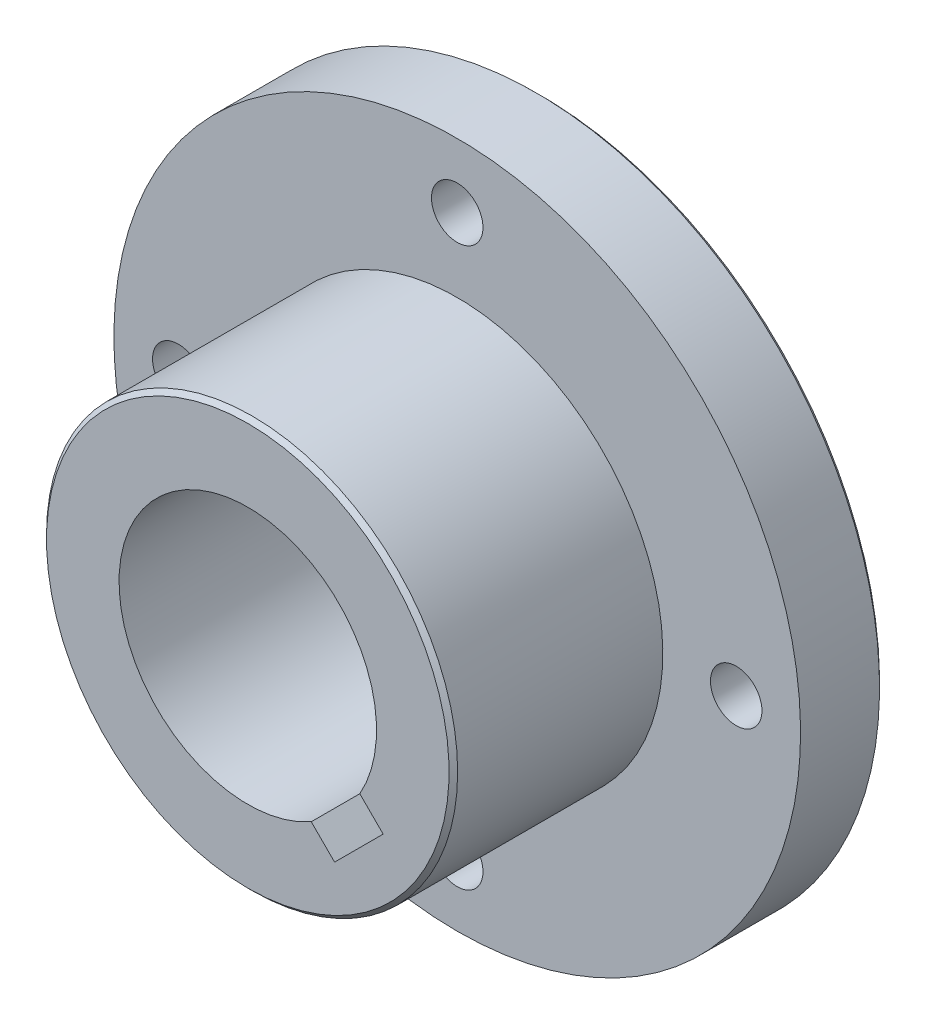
ISO-10303-21;
HEADER;
FILE_DESCRIPTION(('STEP AP214'),'2;1');
FILE_NAME('part.step','',(''),(''),'','','');
FILE_SCHEMA(('AUTOMOTIVE_DESIGN { 1 0 10303 214 1 1 1 1 }'));
ENDSEC;
DATA;
#1=APPLICATION_CONTEXT('core data for automotive mechanical design processes');
#2=APPLICATION_PROTOCOL_DEFINITION('international standard','automotive_design',2000,#1);
#3=PRODUCT_CONTEXT('',#1,'mechanical');
#4=PRODUCT('Part','Part','',(#3));
#5=PRODUCT_RELATED_PRODUCT_CATEGORY('part','',(#4));
#6=PRODUCT_DEFINITION_FORMATION('','',#4);
#7=PRODUCT_DEFINITION_CONTEXT('part definition',#1,'design');
#8=PRODUCT_DEFINITION('design','',#6,#7);
#9=PRODUCT_DEFINITION_SHAPE('','',#8);
#10=(LENGTH_UNIT() NAMED_UNIT(*) SI_UNIT(.MILLI.,.METRE.));
#11=(NAMED_UNIT(*) PLANE_ANGLE_UNIT() SI_UNIT($,.RADIAN.));
#12=(NAMED_UNIT(*) SI_UNIT($,.STERADIAN.) SOLID_ANGLE_UNIT());
#13=UNCERTAINTY_MEASURE_WITH_UNIT(LENGTH_MEASURE(1.E-05),#10,'distance_accuracy_value','');
#14=(GEOMETRIC_REPRESENTATION_CONTEXT(3) GLOBAL_UNCERTAINTY_ASSIGNED_CONTEXT((#13)) GLOBAL_UNIT_ASSIGNED_CONTEXT((#10,
#11,#12)) REPRESENTATION_CONTEXT('',''));
#15=CARTESIAN_POINT('',(0.,0.,0.));
#16=DIRECTION('',(0.,0.,1.));
#17=DIRECTION('',(1.,0.,0.));
#18=AXIS2_PLACEMENT_3D('',#15,#16,#17);
#19=CARTESIAN_POINT('',(-167.832243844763,255.661668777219,11.9555293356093));
#20=DIRECTION('',(0.,0.,1.));
#21=DIRECTION('',(0.,-1.,0.));
#22=AXIS2_PLACEMENT_3D('',#19,#20,#21);
#23=CYLINDRICAL_SURFACE('',#22,40.);
#24=CARTESIAN_POINT('',(-167.832243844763,255.661668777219,16.5555293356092));
#25=DIRECTION('',(0.,0.,1.));
#26=DIRECTION('',(0.,-1.,0.));
#27=AXIS2_PLACEMENT_3D('',#24,#25,#26);
#28=CIRCLE('',#27,40.);
#29=CARTESIAN_POINT('',(-167.832243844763,215.661668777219,16.5555293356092));
#30=VERTEX_POINT('',#29);
#31=EDGE_CURVE('E131',#30,#30,#28,.T.);
#32=ORIENTED_EDGE('',*,*,#31,.F.);
#33=EDGE_LOOP('',(#32));
#34=FACE_BOUND('',#33,.T.);
#35=CARTESIAN_POINT('',(-167.832243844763,255.661668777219,7.35552933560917));
#36=DIRECTION('',(0.,0.,1.));
#37=DIRECTION('',(0.707106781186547,0.707106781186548,0.));
#38=AXIS2_PLACEMENT_3D('',#35,#36,#37);
#39=CIRCLE('',#38,39.9999999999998);
#40=CARTESIAN_POINT('',(-139.547972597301,283.945940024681,7.35552933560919));
#41=VERTEX_POINT('',#40);
#42=EDGE_CURVE('E103',#41,#41,#39,.F.);
#43=ORIENTED_EDGE('',*,*,#42,.F.);
#44=EDGE_LOOP('',(#43));
#45=FACE_BOUND('',#44,.T.);
#46=ADVANCED_FACE('F16',(#34,#45),#23,.T.);
#47=CARTESIAN_POINT('',(-135.332243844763,255.661668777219,6.85552933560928));
#48=DIRECTION('',(0.,0.,-1.));
#49=DIRECTION('',(0.,1.,0.));
#50=AXIS2_PLACEMENT_3D('',#47,#48,#49);
#51=CYLINDRICAL_SURFACE('',#50,3.);
#52=CARTESIAN_POINT('',(-135.332243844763,255.661668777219,16.5555293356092));
#53=DIRECTION('',(0.,0.,-1.));
#54=DIRECTION('',(0.,1.,0.));
#55=AXIS2_PLACEMENT_3D('',#52,#53,#54);
#56=CIRCLE('',#55,3.);
#57=CARTESIAN_POINT('',(-135.332243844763,258.661668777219,16.5555293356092));
#58=VERTEX_POINT('',#57);
#59=EDGE_CURVE('E20',#58,#58,#56,.T.);
#60=ORIENTED_EDGE('',*,*,#59,.F.);
#61=EDGE_LOOP('',(#60));
#62=FACE_BOUND('',#61,.T.);
#63=CARTESIAN_POINT('',(-135.332243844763,255.661668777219,6.85552933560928));
#64=DIRECTION('',(0.,0.,-1.));
#65=DIRECTION('',(0.,1.,0.));
#66=AXIS2_PLACEMENT_3D('',#63,#64,#65);
#67=CIRCLE('',#66,3.);
#68=CARTESIAN_POINT('',(-135.332243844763,258.661668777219,6.85552933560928));
#69=VERTEX_POINT('',#68);
#70=EDGE_CURVE('E128',#69,#69,#67,.F.);
#71=ORIENTED_EDGE('',*,*,#70,.F.);
#72=EDGE_LOOP('',(#71));
#73=FACE_BOUND('',#72,.T.);
#74=ADVANCED_FACE('F148',(#62,#73),#51,.F.);
#75=CARTESIAN_POINT('',(-167.832243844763,223.161668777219,6.85552933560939));
#76=DIRECTION('',(0.,0.,-1.));
#77=DIRECTION('',(0.,1.,0.));
#78=AXIS2_PLACEMENT_3D('',#75,#76,#77);
#79=CYLINDRICAL_SURFACE('',#78,3.);
#80=CARTESIAN_POINT('',(-167.832243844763,223.161668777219,16.5555293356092));
#81=DIRECTION('',(0.,0.,-1.));
#82=DIRECTION('',(0.,1.,0.));
#83=AXIS2_PLACEMENT_3D('',#80,#81,#82);
#84=CIRCLE('',#83,3.);
#85=CARTESIAN_POINT('',(-167.832243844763,226.161668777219,16.5555293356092));
#86=VERTEX_POINT('',#85);
#87=EDGE_CURVE('E139',#86,#86,#84,.T.);
#88=ORIENTED_EDGE('',*,*,#87,.F.);
#89=EDGE_LOOP('',(#88));
#90=FACE_BOUND('',#89,.T.);
#91=CARTESIAN_POINT('',(-167.832243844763,223.161668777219,6.85552933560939));
#92=DIRECTION('',(0.,0.,-1.));
#93=DIRECTION('',(0.,1.,0.));
#94=AXIS2_PLACEMENT_3D('',#91,#92,#93);
#95=CIRCLE('',#94,3.);
#96=CARTESIAN_POINT('',(-167.832243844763,226.161668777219,6.85552933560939));
#97=VERTEX_POINT('',#96);
#98=EDGE_CURVE('E125',#97,#97,#95,.F.);
#99=ORIENTED_EDGE('',*,*,#98,.F.);
#100=EDGE_LOOP('',(#99));
#101=FACE_BOUND('',#100,.T.);
#102=ADVANCED_FACE('F151',(#90,#101),#79,.F.);
#103=CARTESIAN_POINT('',(-200.332243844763,255.661668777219,6.85552933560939));
#104=DIRECTION('',(0.,0.,-1.));
#105=DIRECTION('',(0.,1.,0.));
#106=AXIS2_PLACEMENT_3D('',#103,#104,#105);
#107=CYLINDRICAL_SURFACE('',#106,3.);
#108=CARTESIAN_POINT('',(-200.332243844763,255.661668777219,16.5555293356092));
#109=DIRECTION('',(0.,0.,-1.));
#110=DIRECTION('',(0.,1.,0.));
#111=AXIS2_PLACEMENT_3D('',#108,#109,#110);
#112=CIRCLE('',#111,3.);
#113=CARTESIAN_POINT('',(-200.332243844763,258.661668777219,16.5555293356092));
#114=VERTEX_POINT('',#113);
#115=EDGE_CURVE('E137',#114,#114,#112,.T.);
#116=ORIENTED_EDGE('',*,*,#115,.F.);
#117=EDGE_LOOP('',(#116));
#118=FACE_BOUND('',#117,.T.);
#119=CARTESIAN_POINT('',(-200.332243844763,255.661668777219,6.85552933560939));
#120=DIRECTION('',(0.,0.,-1.));
#121=DIRECTION('',(0.,1.,0.));
#122=AXIS2_PLACEMENT_3D('',#119,#120,#121);
#123=CIRCLE('',#122,3.);
#124=CARTESIAN_POINT('',(-200.332243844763,258.661668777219,6.85552933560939));
#125=VERTEX_POINT('',#124);
#126=EDGE_CURVE('E122',#125,#125,#123,.F.);
#127=ORIENTED_EDGE('',*,*,#126,.F.);
#128=EDGE_LOOP('',(#127));
#129=FACE_BOUND('',#128,.T.);
#130=ADVANCED_FACE('F219',(#118,#129),#107,.F.);
#131=CARTESIAN_POINT('',(-167.832243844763,288.161668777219,6.85552933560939));
#132=DIRECTION('',(0.,0.,-1.));
#133=DIRECTION('',(0.,1.,0.));
#134=AXIS2_PLACEMENT_3D('',#131,#132,#133);
#135=CYLINDRICAL_SURFACE('',#134,3.);
#136=CARTESIAN_POINT('',(-167.832243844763,288.161668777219,16.5555293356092));
#137=DIRECTION('',(0.,0.,-1.));
#138=DIRECTION('',(0.,1.,0.));
#139=AXIS2_PLACEMENT_3D('',#136,#137,#138);
#140=CIRCLE('',#139,3.);
#141=CARTESIAN_POINT('',(-167.832243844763,291.161668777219,16.5555293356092));
#142=VERTEX_POINT('',#141);
#143=EDGE_CURVE('E134',#142,#142,#140,.T.);
#144=ORIENTED_EDGE('',*,*,#143,.F.);
#145=EDGE_LOOP('',(#144));
#146=FACE_BOUND('',#145,.T.);
#147=CARTESIAN_POINT('',(-167.832243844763,288.161668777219,6.85552933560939));
#148=DIRECTION('',(0.,0.,-1.));
#149=DIRECTION('',(0.,1.,0.));
#150=AXIS2_PLACEMENT_3D('',#147,#148,#149);
#151=CIRCLE('',#150,3.);
#152=CARTESIAN_POINT('',(-167.832243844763,291.161668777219,6.85552933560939));
#153=VERTEX_POINT('',#152);
#154=EDGE_CURVE('E119',#153,#153,#151,.F.);
#155=ORIENTED_EDGE('',*,*,#154,.F.);
#156=EDGE_LOOP('',(#155));
#157=FACE_BOUND('',#156,.T.);
#158=ADVANCED_FACE('F225',(#146,#157),#135,.F.);
#159=CARTESIAN_POINT('',(-167.832243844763,255.661668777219,7.35552933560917));
#160=DIRECTION('',(0.,0.,1.));
#161=DIRECTION('',(0.,-1.,0.));
#162=AXIS2_PLACEMENT_3D('',#159,#160,#161);
#163=CONICAL_SURFACE('',#162,39.9999999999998,0.785398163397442);
#164=ORIENTED_EDGE('',*,*,#42,.T.);
#165=EDGE_LOOP('',(#164));
#166=FACE_BOUND('',#165,.T.);
#167=CARTESIAN_POINT('',(-167.832243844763,255.661668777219,6.8555293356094));
#168=DIRECTION('',(0.,0.,1.));
#169=DIRECTION('',(0.,-1.,0.));
#170=AXIS2_PLACEMENT_3D('',#167,#168,#169);
#171=CIRCLE('',#170,39.5);
#172=CARTESIAN_POINT('',(-167.832243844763,216.161668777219,6.85552933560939));
#173=VERTEX_POINT('',#172);
#174=EDGE_CURVE('E116',#173,#173,#171,.F.);
#175=ORIENTED_EDGE('',*,*,#174,.F.);
#176=EDGE_LOOP('',(#175));
#177=FACE_BOUND('',#176,.T.);
#178=ADVANCED_FACE('F168',(#166,#177),#163,.T.);
#179=CARTESIAN_POINT('',(-145.222504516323,278.271408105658,16.5555293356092));
#180=DIRECTION('',(0.,0.,1.));
#181=DIRECTION('',(0.,-1.,0.));
#182=AXIS2_PLACEMENT_3D('',#179,#180,#181);
#183=PLANE('',#182);
#184=CARTESIAN_POINT('',(-167.832243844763,255.661668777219,16.5555293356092));
#185=DIRECTION('',(0.,0.,1.));
#186=DIRECTION('',(0.,-1.,0.));
#187=AXIS2_PLACEMENT_3D('',#184,#185,#186);
#188=CIRCLE('',#187,23.95);
#189=CARTESIAN_POINT('',(-167.832243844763,231.711668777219,16.5555293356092));
#190=VERTEX_POINT('',#189);
#191=EDGE_CURVE('E113',#190,#190,#188,.T.);
#192=ORIENTED_EDGE('',*,*,#191,.F.);
#193=EDGE_LOOP('',(#192));
#194=FACE_BOUND('',#193,.T.);
#195=ORIENTED_EDGE('',*,*,#31,.T.);
#196=EDGE_LOOP('',(#195));
#197=FACE_BOUND('',#196,.T.);
#198=ORIENTED_EDGE('',*,*,#143,.T.);
#199=EDGE_LOOP('',(#198));
#200=FACE_BOUND('',#199,.T.);
#201=ORIENTED_EDGE('',*,*,#115,.T.);
#202=EDGE_LOOP('',(#201));
#203=FACE_BOUND('',#202,.T.);
#204=ORIENTED_EDGE('',*,*,#87,.T.);
#205=EDGE_LOOP('',(#204));
#206=FACE_BOUND('',#205,.T.);
#207=ORIENTED_EDGE('',*,*,#59,.T.);
#208=EDGE_LOOP('',(#207));
#209=FACE_BOUND('',#208,.T.);
#210=ADVANCED_FACE('F146',(#194,#197,#200,#203,#206,#209),#183,.T.);
#211=CARTESIAN_POINT('',(-145.735156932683,277.758755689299,6.85552933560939));
#212=DIRECTION('',(0.,0.,-1.));
#213=DIRECTION('',(0.,1.,0.));
#214=AXIS2_PLACEMENT_3D('',#211,#212,#213);
#215=PLANE('',#214);
#216=ORIENTED_EDGE('',*,*,#174,.T.);
#217=EDGE_LOOP('',(#216));
#218=FACE_BOUND('',#217,.T.);
#219=CARTESIAN_POINT('',(-167.832243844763,255.661668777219,6.85552933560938));
#220=DIRECTION('',(0.,0.,1.));
#221=DIRECTION('',(0.,-1.,0.));
#222=AXIS2_PLACEMENT_3D('',#219,#220,#221);
#223=CIRCLE('',#222,23.);
#224=CARTESIAN_POINT('',(-167.832243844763,232.661668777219,6.85552933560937));
#225=VERTEX_POINT('',#224);
#226=EDGE_CURVE('E102',#225,#225,#223,.F.);
#227=ORIENTED_EDGE('',*,*,#226,.F.);
#228=EDGE_LOOP('',(#227));
#229=FACE_BOUND('',#228,.T.);
#230=ORIENTED_EDGE('',*,*,#154,.T.);
#231=EDGE_LOOP('',(#230));
#232=FACE_BOUND('',#231,.T.);
#233=ORIENTED_EDGE('',*,*,#126,.T.);
#234=EDGE_LOOP('',(#233));
#235=FACE_BOUND('',#234,.T.);
#236=ORIENTED_EDGE('',*,*,#98,.T.);
#237=EDGE_LOOP('',(#236));
#238=FACE_BOUND('',#237,.T.);
#239=ORIENTED_EDGE('',*,*,#70,.T.);
#240=EDGE_LOOP('',(#239));
#241=FACE_BOUND('',#240,.T.);
#242=ADVANCED_FACE('F155',(#218,#229,#232,#235,#238,#241),#215,.T.);
#243=CARTESIAN_POINT('',(-167.832243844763,255.661668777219,28.5055293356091));
#244=DIRECTION('',(0.,0.,1.));
#245=DIRECTION('',(0.,-1.,0.));
#246=AXIS2_PLACEMENT_3D('',#243,#244,#245);
#247=CYLINDRICAL_SURFACE('',#246,23.95);
#248=CARTESIAN_POINT('',(-167.832243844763,255.661668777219,40.4555293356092));
#249=DIRECTION('',(0.,0.,-1.));
#250=DIRECTION('',(0.707106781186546,0.707106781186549,0.));
#251=AXIS2_PLACEMENT_3D('',#248,#249,#250);
#252=CIRCLE('',#251,23.95);
#253=CARTESIAN_POINT('',(-150.897036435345,272.596876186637,40.4555293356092));
#254=VERTEX_POINT('',#253);
#255=EDGE_CURVE('E99',#254,#254,#252,.F.);
#256=ORIENTED_EDGE('',*,*,#255,.F.);
#257=EDGE_LOOP('',(#256));
#258=FACE_BOUND('',#257,.T.);
#259=ORIENTED_EDGE('',*,*,#191,.T.);
#260=EDGE_LOOP('',(#259));
#261=FACE_BOUND('',#260,.T.);
#262=ADVANCED_FACE('F157',(#258,#261),#247,.T.);
#263=CARTESIAN_POINT('',(-167.832243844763,255.661668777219,4.60552933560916));
#264=DIRECTION('',(0.,0.,1.));
#265=DIRECTION('',(0.,-1.,0.));
#266=AXIS2_PLACEMENT_3D('',#263,#264,#265);
#267=CYLINDRICAL_SURFACE('',#266,23.);
#268=ORIENTED_EDGE('',*,*,#226,.T.);
#269=EDGE_LOOP('',(#268));
#270=FACE_BOUND('',#269,.T.);
#271=CARTESIAN_POINT('',(-167.832243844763,255.661668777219,2.35552933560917));
#272=DIRECTION('',(0.,0.,1.));
#273=DIRECTION('',(0.707106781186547,0.707106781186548,0.));
#274=AXIS2_PLACEMENT_3D('',#271,#272,#273);
#275=CIRCLE('',#274,23.);
#276=CARTESIAN_POINT('',(-151.568787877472,271.925124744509,2.35552933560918));
#277=VERTEX_POINT('',#276);
#278=EDGE_CURVE('E91',#277,#277,#275,.F.);
#279=ORIENTED_EDGE('',*,*,#278,.F.);
#280=EDGE_LOOP('',(#279));
#281=FACE_BOUND('',#280,.T.);
#282=ADVANCED_FACE('F165',(#270,#281),#267,.T.);
#283=CARTESIAN_POINT('',(-167.832243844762,255.661668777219,40.4555293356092));
#284=DIRECTION('',(0.,0.,-1.));
#285=DIRECTION('',(0.,1.,0.));
#286=AXIS2_PLACEMENT_3D('',#283,#284,#285);
#287=CONICAL_SURFACE('',#286,23.95,0.785398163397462);
#288=CARTESIAN_POINT('',(-167.832243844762,255.661668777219,40.9555293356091));
#289=DIRECTION('',(0.,0.,-1.));
#290=DIRECTION('',(0.,1.,0.));
#291=AXIS2_PLACEMENT_3D('',#288,#289,#290);
#292=CIRCLE('',#291,23.4500000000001);
#293=CARTESIAN_POINT('',(-167.832243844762,279.111668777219,40.9555293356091));
#294=VERTEX_POINT('',#293);
#295=EDGE_CURVE('E85',#294,#294,#292,.F.);
#296=ORIENTED_EDGE('',*,*,#295,.F.);
#297=EDGE_LOOP('',(#296));
#298=FACE_BOUND('',#297,.T.);
#299=ORIENTED_EDGE('',*,*,#255,.T.);
#300=EDGE_LOOP('',(#299));
#301=FACE_BOUND('',#300,.T.);
#302=ADVANCED_FACE('F197',(#298,#301),#287,.T.);
#303=CARTESIAN_POINT('',(-167.832243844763,255.661668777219,2.35552933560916));
#304=DIRECTION('',(0.,0.,1.));
#305=DIRECTION('',(0.,-1.,0.));
#306=AXIS2_PLACEMENT_3D('',#303,#304,#305);
#307=CONICAL_SURFACE('',#306,23.,0.78539816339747);
#308=ORIENTED_EDGE('',*,*,#278,.T.);
#309=EDGE_LOOP('',(#308));
#310=FACE_BOUND('',#309,.T.);
#311=CARTESIAN_POINT('',(-167.832243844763,255.661668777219,1.85552933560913));
#312=DIRECTION('',(0.,0.,1.));
#313=DIRECTION('',(0.,-1.,0.));
#314=AXIS2_PLACEMENT_3D('',#311,#312,#313);
#315=CIRCLE('',#314,22.5);
#316=CARTESIAN_POINT('',(-167.832243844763,233.161668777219,1.85552933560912));
#317=VERTEX_POINT('',#316);
#318=EDGE_CURVE('E79',#317,#317,#315,.F.);
#319=ORIENTED_EDGE('',*,*,#318,.F.);
#320=EDGE_LOOP('',(#319));
#321=FACE_BOUND('',#320,.T.);
#322=ADVANCED_FACE('F193',(#310,#321),#307,.T.);
#323=CARTESIAN_POINT('',(-157.720616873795,239.893187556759,0.955529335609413));
#324=DIRECTION('',(0.707106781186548,-0.707106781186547,0.));
#325=DIRECTION('',(0.707106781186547,0.707106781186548,0.));
#326=AXIS2_PLACEMENT_3D('',#323,#324,#325);
#327=PLANE('',#326);
#328=DIRECTION('',(0.,0.,1.));
#329=VECTOR('',#328,1.);
#330=CARTESIAN_POINT('',(-157.720616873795,239.893187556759,0.955529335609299));
#331=LINE('',#330,#329);
#332=CARTESIAN_POINT('',(-157.720616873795,239.893187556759,1.85552933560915));
#333=VERTEX_POINT('',#332);
#334=CARTESIAN_POINT('',(-157.720616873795,239.893187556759,40.9555293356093));
#335=VERTEX_POINT('',#334);
#336=EDGE_CURVE('E80',#333,#335,#331,.T.);
#337=ORIENTED_EDGE('',*,*,#336,.T.);
#338=DIRECTION('',(-0.707106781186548,-0.707106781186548,0.));
#339=VECTOR('',#338,1.);
#340=CARTESIAN_POINT('',(-152.063762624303,245.550041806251,40.9555293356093));
#341=LINE('',#340,#339);
#342=CARTESIAN_POINT('',(-152.063762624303,245.550041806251,40.9555293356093));
#343=VERTEX_POINT('',#342);
#344=EDGE_CURVE('E61',#343,#335,#341,.T.);
#345=ORIENTED_EDGE('',*,*,#344,.F.);
#346=DIRECTION('',(0.,0.,1.));
#347=VECTOR('',#346,1.);
#348=CARTESIAN_POINT('',(-152.063762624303,245.550041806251,0.955529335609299));
#349=LINE('',#348,#347);
#350=CARTESIAN_POINT('',(-152.063762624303,245.550041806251,1.85552933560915));
#351=VERTEX_POINT('',#350);
#352=EDGE_CURVE('E57',#343,#351,#349,.F.);
#353=ORIENTED_EDGE('',*,*,#352,.T.);
#354=DIRECTION('',(0.707106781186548,0.707106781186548,0.));
#355=VECTOR('',#354,1.);
#356=CARTESIAN_POINT('',(-157.720616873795,239.893187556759,1.85552933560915));
#357=LINE('',#356,#355);
#358=EDGE_CURVE('E71',#333,#351,#357,.T.);
#359=ORIENTED_EDGE('',*,*,#358,.F.);
#360=EDGE_LOOP('',(#337,#345,#353,#359));
#361=FACE_BOUND('',#360,.T.);
#362=ADVANCED_FACE('F190',(#361),#327,.F.);
#363=CARTESIAN_POINT('',(-152.063762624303,245.550041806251,0.955529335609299));
#364=DIRECTION('',(0.707106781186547,0.707106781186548,0.));
#365=DIRECTION('',(-0.707106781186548,0.707106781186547,0.));
#366=AXIS2_PLACEMENT_3D('',#363,#364,#365);
#367=PLANE('',#366);
#368=DIRECTION('',(-0.707106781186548,0.707106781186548,0.));
#369=VECTOR('',#368,1.);
#370=CARTESIAN_POINT('',(-152.063762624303,245.550041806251,1.85552933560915));
#371=LINE('',#370,#369);
#372=CARTESIAN_POINT('',(-154.781292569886,248.267571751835,1.85552933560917));
#373=VERTEX_POINT('',#372);
#374=EDGE_CURVE('E108',#351,#373,#371,.T.);
#375=ORIENTED_EDGE('',*,*,#374,.F.);
#376=ORIENTED_EDGE('',*,*,#352,.F.);
#377=DIRECTION('',(0.707106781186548,-0.707106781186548,0.));
#378=VECTOR('',#377,1.);
#379=CARTESIAN_POINT('',(-154.781292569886,248.267571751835,40.9555293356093));
#380=LINE('',#379,#378);
#381=CARTESIAN_POINT('',(-154.781292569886,248.267571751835,40.9555293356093));
#382=VERTEX_POINT('',#381);
#383=EDGE_CURVE('E49',#382,#343,#380,.T.);
#384=ORIENTED_EDGE('',*,*,#383,.F.);
#385=DIRECTION('',(0.,0.,1.));
#386=VECTOR('',#385,1.);
#387=CARTESIAN_POINT('',(-154.781292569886,248.267571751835,21.4055293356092));
#388=LINE('',#387,#386);
#389=EDGE_CURVE('E54',#373,#382,#388,.T.);
#390=ORIENTED_EDGE('',*,*,#389,.F.);
#391=EDGE_LOOP('',(#375,#376,#384,#390));
#392=FACE_BOUND('',#391,.T.);
#393=ADVANCED_FACE('F52',(#392),#367,.F.);
#394=CARTESIAN_POINT('',(-154.238115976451,269.25579664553,40.9555293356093));
#395=DIRECTION('',(0.,0.,1.));
#396=DIRECTION('',(0.,-1.,0.));
#397=AXIS2_PLACEMENT_3D('',#394,#395,#396);
#398=PLANE('',#397);
#399=ORIENTED_EDGE('',*,*,#295,.T.);
#400=EDGE_LOOP('',(#399));
#401=FACE_BOUND('',#400,.T.);
#402=DIRECTION('',(0.707106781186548,-0.707106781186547,0.));
#403=VECTOR('',#402,1.);
#404=CARTESIAN_POINT('',(-164.79168468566,246.964255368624,40.9555293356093));
#405=LINE('',#404,#403);
#406=CARTESIAN_POINT('',(-160.438146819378,242.610717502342,40.9555293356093));
#407=VERTEX_POINT('',#406);
#408=EDGE_CURVE('E67',#335,#407,#405,.F.);
#409=ORIENTED_EDGE('',*,*,#408,.T.);
#410=CARTESIAN_POINT('',(-167.832243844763,255.661668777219,40.9555293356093));
#411=DIRECTION('',(0.,0.,1.));
#412=DIRECTION('',(1.,0.,0.));
#413=AXIS2_PLACEMENT_3D('',#410,#411,#412);
#414=CIRCLE('',#413,15.);
#415=EDGE_CURVE('E64',#382,#407,#414,.T.);
#416=ORIENTED_EDGE('',*,*,#415,.F.);
#417=ORIENTED_EDGE('',*,*,#383,.T.);
#418=ORIENTED_EDGE('',*,*,#344,.T.);
#419=EDGE_LOOP('',(#409,#416,#417,#418));
#420=FACE_BOUND('',#419,.T.);
#421=ADVANCED_FACE('F65',(#401,#420),#398,.T.);
#422=CARTESIAN_POINT('',(-164.79168468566,246.964255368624,0.955529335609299));
#423=DIRECTION('',(-0.707106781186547,-0.707106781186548,0.));
#424=DIRECTION('',(0.707106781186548,-0.707106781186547,0.));
#425=AXIS2_PLACEMENT_3D('',#422,#423,#424);
#426=PLANE('',#425);
#427=ORIENTED_EDGE('',*,*,#408,.F.);
#428=ORIENTED_EDGE('',*,*,#336,.F.);
#429=DIRECTION('',(0.707106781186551,-0.707106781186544,0.));
#430=VECTOR('',#429,1.);
#431=CARTESIAN_POINT('',(-160.438146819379,242.610717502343,1.85552933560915));
#432=LINE('',#431,#430);
#433=CARTESIAN_POINT('',(-160.438146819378,242.610717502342,1.85552933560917));
#434=VERTEX_POINT('',#433);
#435=EDGE_CURVE('E34',#434,#333,#432,.T.);
#436=ORIENTED_EDGE('',*,*,#435,.F.);
#437=DIRECTION('',(0.,0.,1.));
#438=VECTOR('',#437,1.);
#439=CARTESIAN_POINT('',(-160.438146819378,242.610717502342,21.4055293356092));
#440=LINE('',#439,#438);
#441=EDGE_CURVE('E26',#407,#434,#440,.F.);
#442=ORIENTED_EDGE('',*,*,#441,.F.);
#443=EDGE_LOOP('',(#427,#428,#436,#442));
#444=FACE_BOUND('',#443,.T.);
#445=ADVANCED_FACE('F177',(#444),#426,.F.);
#446=CARTESIAN_POINT('',(-154.573991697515,268.919920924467,1.85552933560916));
#447=DIRECTION('',(0.,0.,-1.));
#448=DIRECTION('',(0.,1.,0.));
#449=AXIS2_PLACEMENT_3D('',#446,#447,#448);
#450=PLANE('',#449);
#451=ORIENTED_EDGE('',*,*,#435,.T.);
#452=ORIENTED_EDGE('',*,*,#358,.T.);
#453=ORIENTED_EDGE('',*,*,#374,.T.);
#454=CARTESIAN_POINT('',(-167.832243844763,255.661668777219,1.85552933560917));
#455=DIRECTION('',(0.,0.,1.));
#456=DIRECTION('',(1.,0.,0.));
#457=AXIS2_PLACEMENT_3D('',#454,#455,#456);
#458=CIRCLE('',#457,15.);
#459=EDGE_CURVE('E10',#434,#373,#458,.F.);
#460=ORIENTED_EDGE('',*,*,#459,.F.);
#461=EDGE_LOOP('',(#451,#452,#453,#460));
#462=FACE_BOUND('',#461,.T.);
#463=ORIENTED_EDGE('',*,*,#318,.T.);
#464=EDGE_LOOP('',(#463));
#465=FACE_BOUND('',#464,.T.);
#466=ADVANCED_FACE('F173',(#462,#465),#450,.T.);
#467=CARTESIAN_POINT('',(-167.832243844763,255.661668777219,1.85552933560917));
#468=DIRECTION('',(0.,0.,1.));
#469=DIRECTION('',(1.,0.,0.));
#470=AXIS2_PLACEMENT_3D('',#467,#468,#469);
#471=CYLINDRICAL_SURFACE('',#470,15.);
#472=ORIENTED_EDGE('',*,*,#441,.T.);
#473=ORIENTED_EDGE('',*,*,#459,.T.);
#474=ORIENTED_EDGE('',*,*,#389,.T.);
#475=ORIENTED_EDGE('',*,*,#415,.T.);
#476=EDGE_LOOP('',(#472,#473,#474,#475));
#477=FACE_BOUND('',#476,.T.);
#478=ADVANCED_FACE('F18',(#477),#471,.F.);
#479=CLOSED_SHELL('',(#46,#74,#102,#130,#158,#178,#210,#242,#262,#282,#302,#322,#362,#393,#421,
#445,#466,#478));
#480=MANIFOLD_SOLID_BREP('B1',#479);
#481=ADVANCED_BREP_SHAPE_REPRESENTATION('',(#18,#480),#14);
#482=SHAPE_DEFINITION_REPRESENTATION(#9,#481);
ENDSEC;
END-ISO-10303-21;
